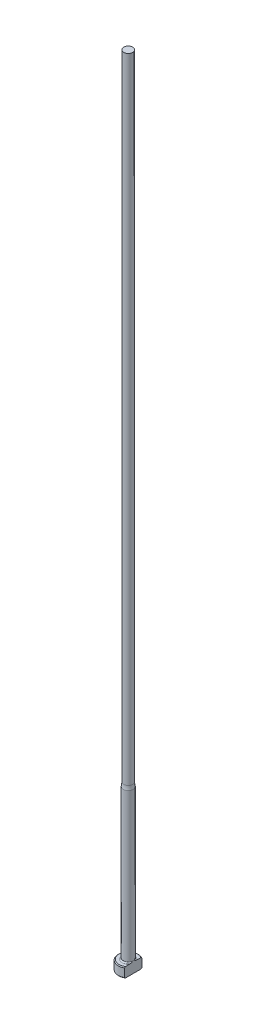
ISO-10303-21;
HEADER;
FILE_DESCRIPTION(('STEP AP214'),'2;1');
FILE_NAME('part.step','',(''),(''),'','','');
FILE_SCHEMA(('AUTOMOTIVE_DESIGN { 1 0 10303 214 1 1 1 1 }'));
ENDSEC;
DATA;
#1=APPLICATION_CONTEXT('core data for automotive mechanical design processes');
#2=APPLICATION_PROTOCOL_DEFINITION('international standard','automotive_design',2000,#1);
#3=PRODUCT_CONTEXT('',#1,'mechanical');
#4=PRODUCT('Part','Part','',(#3));
#5=PRODUCT_RELATED_PRODUCT_CATEGORY('part','',(#4));
#6=PRODUCT_DEFINITION_FORMATION('','',#4);
#7=PRODUCT_DEFINITION_CONTEXT('part definition',#1,'design');
#8=PRODUCT_DEFINITION('design','',#6,#7);
#9=PRODUCT_DEFINITION_SHAPE('','',#8);
#10=(LENGTH_UNIT() NAMED_UNIT(*) SI_UNIT(.MILLI.,.METRE.));
#11=(NAMED_UNIT(*) PLANE_ANGLE_UNIT() SI_UNIT($,.RADIAN.));
#12=(NAMED_UNIT(*) SI_UNIT($,.STERADIAN.) SOLID_ANGLE_UNIT());
#13=UNCERTAINTY_MEASURE_WITH_UNIT(LENGTH_MEASURE(1.E-05),#10,'distance_accuracy_value','');
#14=(GEOMETRIC_REPRESENTATION_CONTEXT(3) GLOBAL_UNCERTAINTY_ASSIGNED_CONTEXT((#13)) GLOBAL_UNIT_ASSIGNED_CONTEXT((#10,
#11,#12)) REPRESENTATION_CONTEXT('',''));
#15=CARTESIAN_POINT('',(0.,0.,0.));
#16=DIRECTION('',(0.,0.,1.));
#17=DIRECTION('',(1.,0.,0.));
#18=AXIS2_PLACEMENT_3D('',#15,#16,#17);
#19=CARTESIAN_POINT('',(-3.17499999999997,3.175,0.));
#20=DIRECTION('',(0.,1.,0.));
#21=DIRECTION('',(0.,0.,1.));
#22=AXIS2_PLACEMENT_3D('',#19,#20,#21);
#23=PLANE('',#22);
#24=CARTESIAN_POINT('',(0.,3.175,0.));
#25=DIRECTION('',(0.,1.,0.));
#26=DIRECTION('',(0.,0.,1.));
#27=AXIS2_PLACEMENT_3D('',#24,#25,#26);
#28=CIRCLE('',#27,2.92099999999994);
#29=CARTESIAN_POINT('',(1.58749999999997,3.175,-2.45195529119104));
#30=VERTEX_POINT('',#29);
#31=CARTESIAN_POINT('',(1.58749999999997,3.175,2.45195529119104));
#32=VERTEX_POINT('',#31);
#33=EDGE_CURVE('E105',#30,#32,#28,.T.);
#34=ORIENTED_EDGE('',*,*,#33,.T.);
#35=DIRECTION('',(0.,0.,1.));
#36=VECTOR('',#35,1.);
#37=CARTESIAN_POINT('',(1.58749999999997,3.17499999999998,2.74963065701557));
#38=LINE('',#37,#36);
#39=CARTESIAN_POINT('',(1.58749999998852,3.175,1.16397422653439));
#40=VERTEX_POINT('',#39);
#41=EDGE_CURVE('E126',#40,#32,#38,.T.);
#42=ORIENTED_EDGE('',*,*,#41,.F.);
#43=CARTESIAN_POINT('',(0.,3.175,0.));
#44=DIRECTION('',(0.,1.,0.));
#45=DIRECTION('',(0.,0.,1.));
#46=AXIS2_PLACEMENT_3D('',#43,#44,#45);
#47=CIRCLE('',#46,1.96849999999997);
#48=CARTESIAN_POINT('',(1.58749999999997,3.175,-1.16397422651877));
#49=VERTEX_POINT('',#48);
#50=EDGE_CURVE('E11',#40,#49,#47,.F.);
#51=ORIENTED_EDGE('',*,*,#50,.T.);
#52=EDGE_CURVE('E52',#30,#49,#38,.T.);
#53=ORIENTED_EDGE('',*,*,#52,.F.);
#54=EDGE_LOOP('',(#34,#42,#51,#53));
#55=FACE_BOUND('',#54,.T.);
#56=ADVANCED_FACE('F32',(#55),#23,.T.);
#57=CARTESIAN_POINT('',(0.,259.958771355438,0.));
#58=DIRECTION('',(0.,1.,0.));
#59=DIRECTION('',(0.,0.,1.));
#60=AXIS2_PLACEMENT_3D('',#57,#58,#59);
#61=CYLINDRICAL_SURFACE('',#60,3.17499999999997);
#62=CARTESIAN_POINT('',(0.,2.92100000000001,0.));
#63=DIRECTION('',(0.,1.,0.));
#64=DIRECTION('',(0.,0.,1.));
#65=AXIS2_PLACEMENT_3D('',#62,#63,#64);
#66=CIRCLE('',#65,3.17499999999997);
#67=CARTESIAN_POINT('',(1.58749999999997,2.92100000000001,2.74963065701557));
#68=VERTEX_POINT('',#67);
#69=CARTESIAN_POINT('',(1.58749999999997,2.92100000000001,-2.74963065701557));
#70=VERTEX_POINT('',#69);
#71=EDGE_CURVE('E98',#68,#70,#66,.F.);
#72=ORIENTED_EDGE('',*,*,#71,.T.);
#73=DIRECTION('',(0.,-1.,0.));
#74=VECTOR('',#73,1.);
#75=CARTESIAN_POINT('',(1.58749999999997,254.001,-2.74963065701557));
#76=LINE('',#75,#74);
#77=CARTESIAN_POINT('',(1.58749999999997,0.253999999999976,-2.74963065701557));
#78=VERTEX_POINT('',#77);
#79=EDGE_CURVE('E141',#70,#78,#76,.T.);
#80=ORIENTED_EDGE('',*,*,#79,.T.);
#81=CARTESIAN_POINT('',(0.,0.253999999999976,0.));
#82=DIRECTION('',(0.,-1.,0.));
#83=DIRECTION('',(0.,0.,-1.));
#84=AXIS2_PLACEMENT_3D('',#81,#82,#83);
#85=CIRCLE('',#84,3.17499999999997);
#86=CARTESIAN_POINT('',(1.58749999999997,0.253999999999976,2.74963065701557));
#87=VERTEX_POINT('',#86);
#88=EDGE_CURVE('E95',#78,#87,#85,.F.);
#89=ORIENTED_EDGE('',*,*,#88,.T.);
#90=DIRECTION('',(0.,-1.,0.));
#91=VECTOR('',#90,1.);
#92=CARTESIAN_POINT('',(1.58749999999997,254.001,2.74963065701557));
#93=LINE('',#92,#91);
#94=EDGE_CURVE('E88',#68,#87,#93,.T.);
#95=ORIENTED_EDGE('',*,*,#94,.F.);
#96=EDGE_LOOP('',(#72,#80,#89,#95));
#97=FACE_BOUND('',#96,.T.);
#98=ADVANCED_FACE('F191',(#97),#61,.T.);
#99=CARTESIAN_POINT('',(0.,0.,0.));
#100=DIRECTION('',(0.,-1.,0.));
#101=DIRECTION('',(0.,0.,-1.));
#102=AXIS2_PLACEMENT_3D('',#99,#100,#101);
#103=PLANE('',#102);
#104=CARTESIAN_POINT('',(0.,0.,0.));
#105=DIRECTION('',(0.,-1.,0.));
#106=DIRECTION('',(0.,0.,-1.));
#107=AXIS2_PLACEMENT_3D('',#104,#105,#106);
#108=CIRCLE('',#107,2.92100000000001);
#109=CARTESIAN_POINT('',(1.58749999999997,0.,2.45195529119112));
#110=VERTEX_POINT('',#109);
#111=CARTESIAN_POINT('',(1.58749999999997,0.,-2.45195529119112));
#112=VERTEX_POINT('',#111);
#113=EDGE_CURVE('E93',#110,#112,#108,.T.);
#114=ORIENTED_EDGE('',*,*,#113,.T.);
#115=DIRECTION('',(0.,0.,1.));
#116=VECTOR('',#115,1.);
#117=CARTESIAN_POINT('',(1.58749999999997,0.,2.74963065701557));
#118=LINE('',#117,#116);
#119=EDGE_CURVE('E78',#112,#110,#118,.T.);
#120=ORIENTED_EDGE('',*,*,#119,.T.);
#121=EDGE_LOOP('',(#114,#120));
#122=FACE_BOUND('',#121,.T.);
#123=ADVANCED_FACE('F97',(#122),#103,.T.);
#124=CARTESIAN_POINT('',(0.,3.17499999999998,0.));
#125=DIRECTION('',(0.,-1.,0.));
#126=DIRECTION('',(0.,0.,-1.));
#127=AXIS2_PLACEMENT_3D('',#124,#125,#126);
#128=CONICAL_SURFACE('',#127,2.92099999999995,0.785398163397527);
#129=ORIENTED_EDGE('',*,*,#71,.F.);
#130=CARTESIAN_POINT('',(1.58749999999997,-0.16162066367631,-6.0529050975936));
#131=CARTESIAN_POINT('',(1.58749999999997,-0.0288893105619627,-5.91567682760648));
#132=CARTESIAN_POINT('',(1.58749999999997,0.103699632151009,-5.7783103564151));
#133=CARTESIAN_POINT('',(1.58749999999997,0.368508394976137,-5.50321874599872));
#134=CARTESIAN_POINT('',(1.58749999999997,0.500728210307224,-5.36549360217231));
#135=CARTESIAN_POINT('',(1.58749999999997,0.764778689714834,-5.08953516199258));
#136=CARTESIAN_POINT('',(1.58749999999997,0.896609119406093,-4.9513016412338));
#137=CARTESIAN_POINT('',(1.58749999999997,1.15968706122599,-4.67428233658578));
#138=CARTESIAN_POINT('',(1.58749999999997,1.29093457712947,-4.53549655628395));
#139=CARTESIAN_POINT('',(1.58749999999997,1.55007705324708,-4.25997724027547));
#140=CARTESIAN_POINT('',(1.58749999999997,1.67798684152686,-4.12325766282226));
#141=CARTESIAN_POINT('',(1.58749999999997,1.9328486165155,-3.84892898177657));
#142=CARTESIAN_POINT('',(1.58749999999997,2.05980060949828,-3.71131988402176));
#143=CARTESIAN_POINT('',(1.58749999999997,2.31237508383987,-3.43493978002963));
#144=CARTESIAN_POINT('',(1.58749999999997,2.43799784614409,-3.29616903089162));
#145=CARTESIAN_POINT('',(1.58749999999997,2.68741369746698,-3.01699558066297));
#146=CARTESIAN_POINT('',(1.58749999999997,2.81120686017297,-2.8765929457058));
#147=CARTESIAN_POINT('',(1.58749999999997,3.00875865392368,-2.64816703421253));
#148=CARTESIAN_POINT('',(1.58749999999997,3.08336151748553,-2.56087478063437));
#149=CARTESIAN_POINT('',(1.58749999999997,3.2312387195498,-2.38515423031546));
#150=CARTESIAN_POINT('',(1.58749999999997,3.30451292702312,-2.29672582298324));
#151=CARTESIAN_POINT('',(1.58749999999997,3.45004422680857,-2.1174740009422));
#152=CARTESIAN_POINT('',(1.58749999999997,3.5222823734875,-2.02663514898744));
#153=CARTESIAN_POINT('',(1.58749999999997,3.66423097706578,-1.8430252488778));
#154=CARTESIAN_POINT('',(1.58749999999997,3.73394203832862,-1.75025467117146));
#155=CARTESIAN_POINT('',(1.58749999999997,3.87080633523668,-1.5606747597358));
#156=CARTESIAN_POINT('',(1.58749999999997,3.93790459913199,-1.46382547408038));
#157=CARTESIAN_POINT('',(1.58749999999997,4.06669147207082,-1.26632594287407));
#158=CARTESIAN_POINT('',(1.58749999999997,4.1283726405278,-1.16567073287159));
#159=CARTESIAN_POINT('',(1.58749999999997,4.21402252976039,-1.01165766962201));
#160=CARTESIAN_POINT('',(1.58749999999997,4.24127929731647,-0.960142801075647));
#161=CARTESIAN_POINT('',(1.58749999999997,4.2930979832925,-0.855780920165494));
#162=CARTESIAN_POINT('',(1.58749999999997,4.31765941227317,-0.802933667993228));
#163=CARTESIAN_POINT('',(1.58749999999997,4.38614656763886,-0.642461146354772));
#164=CARTESIAN_POINT('',(1.58749999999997,4.42510149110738,-0.532518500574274));
#165=CARTESIAN_POINT('',(1.58749999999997,4.46726244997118,-0.367680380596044));
#166=CARTESIAN_POINT('',(1.58749999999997,4.47844427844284,-0.314802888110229));
#167=CARTESIAN_POINT('',(1.58749999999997,4.49576654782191,-0.208209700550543));
#168=CARTESIAN_POINT('',(1.58749999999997,4.50190743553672,-0.154494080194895));
#169=CARTESIAN_POINT('',(1.58749999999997,4.50871296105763,-0.0468792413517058));
#170=CARTESIAN_POINT('',(1.58749999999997,4.5093945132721,0.00701889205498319));
#171=CARTESIAN_POINT('',(1.58749999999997,4.50527679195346,0.114606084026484));
#172=CARTESIAN_POINT('',(1.58749999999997,4.50047706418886,0.168295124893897));
#173=CARTESIAN_POINT('',(1.58749999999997,4.48579689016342,0.27448544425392));
#174=CARTESIAN_POINT('',(1.58749999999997,4.47596081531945,0.32699298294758));
#175=CARTESIAN_POINT('',(1.58749999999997,4.45181809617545,0.430974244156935));
#176=CARTESIAN_POINT('',(1.58749999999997,4.4375096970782,0.482447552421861));
#177=CARTESIAN_POINT('',(1.58749999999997,4.40502489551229,0.584460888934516));
#178=CARTESIAN_POINT('',(1.58749999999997,4.386827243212,0.634994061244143));
#179=CARTESIAN_POINT('',(1.58749999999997,4.34729308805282,0.734789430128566));
#180=CARTESIAN_POINT('',(1.58749999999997,4.3259572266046,0.784051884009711));
#181=CARTESIAN_POINT('',(1.58749999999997,4.25791922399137,0.930549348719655));
#182=CARTESIAN_POINT('',(1.58749999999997,4.20736047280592,1.0259880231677));
#183=CARTESIAN_POINT('',(1.58749999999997,4.0995545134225,1.21304313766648));
#184=CARTESIAN_POINT('',(1.58749999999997,4.04229912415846,1.30465471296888));
#185=CARTESIAN_POINT('',(1.58749999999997,3.92308746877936,1.48526211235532));
#186=CARTESIAN_POINT('',(1.58749999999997,3.86111349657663,1.57424615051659));
#187=CARTESIAN_POINT('',(1.58749999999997,3.73408621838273,1.74990003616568));
#188=CARTESIAN_POINT('',(1.58749999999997,3.66903444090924,1.83657099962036));
#189=CARTESIAN_POINT('',(1.58749999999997,3.53583371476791,2.00931764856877));
#190=CARTESIAN_POINT('',(1.58749999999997,3.46765527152,2.09537048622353));
#191=CARTESIAN_POINT('',(1.58749999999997,3.32960643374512,2.26611736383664));
#192=CARTESIAN_POINT('',(1.58749999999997,3.25973586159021,2.35081125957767));
#193=CARTESIAN_POINT('',(1.58749999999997,3.04858139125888,2.60290121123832));
#194=CARTESIAN_POINT('',(1.58749999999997,2.90542388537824,2.76872537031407));
#195=CARTESIAN_POINT('',(1.58749999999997,2.64069522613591,3.06970913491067));
#196=CARTESIAN_POINT('',(1.58749999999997,2.51959458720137,3.20528660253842));
#197=CARTESIAN_POINT('',(1.58749999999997,2.27590400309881,3.47510321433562));
#198=CARTESIAN_POINT('',(1.58749999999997,2.15331401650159,3.60934232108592));
#199=CARTESIAN_POINT('',(1.58749999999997,1.90694239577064,3.87695374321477));
#200=CARTESIAN_POINT('',(1.58749999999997,1.78315974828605,4.0103251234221));
#201=CARTESIAN_POINT('',(1.58749999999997,1.53478104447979,4.27630880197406));
#202=CARTESIAN_POINT('',(1.58749999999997,1.41018498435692,4.40892109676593));
#203=CARTESIAN_POINT('',(1.58749999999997,1.0457468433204,4.79499418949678));
#204=CARTESIAN_POINT('',(1.58749999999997,0.80507680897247,5.04767313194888));
#205=CARTESIAN_POINT('',(1.58749999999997,0.443121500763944,5.42550911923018));
#206=CARTESIAN_POINT('',(1.58749999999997,0.322378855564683,5.55118772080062));
#207=CARTESIAN_POINT('',(1.58749999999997,0.0805914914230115,5.80225207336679));
#208=CARTESIAN_POINT('',(1.58749999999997,-0.040453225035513,5.92763782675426));
#209=CARTESIAN_POINT('',(1.58749999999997,-0.161620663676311,6.0529050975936));
#210=B_SPLINE_CURVE_WITH_KNOTS('',3,(#130,#131,#132,#133,#134,#135,#136,#137,#138,#139,#140,
#141,#142,#143,#144,#145,#146,#147,#148,#149,#150,#151,#152,#153,#154,#155,#156,#157,#158,#159,
#160,#161,#162,#163,#164,#165,#166,#167,#168,#169,#170,#171,#172,#173,#174,#175,#176,#177,#178,
#179,#180,#181,#182,#183,#184,#185,#186,#187,#188,#189,#190,#191,#192,#193,#194,#195,#196,#197,
#198,#199,#200,#201,#202,#203,#204,#205,#206,#207,#208,#209),.UNSPECIFIED.,.F.,.F.,(4,2,2,2,2,2,
2,2,2,2,2,2,2,2,2,2,2,2,2,2,2,2,2,2,2,2,2,2,2,2,2,2,2,2,2,2,2,2,2,4),(0.,0.572750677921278,
1.14550874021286,1.71856057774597,2.29160869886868,2.85328006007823,3.4149477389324,
3.97649423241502,4.53801804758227,4.88249307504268,5.22700189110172,5.5751532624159,
5.92322081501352,6.27657800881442,6.63041319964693,6.80518126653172,6.9799810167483,
7.3282426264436,7.49018491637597,7.65211285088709,7.81353889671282,7.97497832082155,
8.13501929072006,8.29512313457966,8.45612518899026,8.61709438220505,8.94062993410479,
9.2645649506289,9.58978187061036,9.91483894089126,10.2441741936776,10.5735441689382,
11.2306812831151,11.7760337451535,12.3214014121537,12.8672825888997,13.4131663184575,
14.4600164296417,14.9828595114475,15.5056983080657),.UNSPECIFIED.);
#211=EDGE_CURVE('E118',#32,#68,#210,.T.);
#212=ORIENTED_EDGE('',*,*,#211,.F.);
#213=ORIENTED_EDGE('',*,*,#33,.F.);
#214=EDGE_CURVE('E117',#70,#30,#210,.T.);
#215=ORIENTED_EDGE('',*,*,#214,.F.);
#216=EDGE_LOOP('',(#129,#212,#213,#215));
#217=FACE_BOUND('',#216,.T.);
#218=ADVANCED_FACE('F162',(#217),#128,.T.);
#219=CARTESIAN_POINT('',(0.,0.253999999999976,0.));
#220=DIRECTION('',(0.,1.,0.));
#221=DIRECTION('',(0.,0.,1.));
#222=AXIS2_PLACEMENT_3D('',#219,#220,#221);
#223=CONICAL_SURFACE('',#222,3.17499999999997,0.785398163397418);
#224=ORIENTED_EDGE('',*,*,#88,.F.);
#225=CARTESIAN_POINT('',(1.58749999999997,3.33662066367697,6.0529050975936));
#226=CARTESIAN_POINT('',(1.58749999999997,3.20388931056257,5.91567682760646));
#227=CARTESIAN_POINT('',(1.58749999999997,3.07130036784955,5.77831035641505));
#228=CARTESIAN_POINT('',(1.58749999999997,2.80649160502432,5.50321874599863));
#229=CARTESIAN_POINT('',(1.58749999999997,2.67427178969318,5.3654936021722));
#230=CARTESIAN_POINT('',(1.58749999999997,2.41022131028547,5.08953516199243));
#231=CARTESIAN_POINT('',(1.58749999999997,2.27839088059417,4.95130164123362));
#232=CARTESIAN_POINT('',(1.58749999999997,2.01531293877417,4.67428233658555));
#233=CARTESIAN_POINT('',(1.58749999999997,1.88406542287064,4.5354965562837));
#234=CARTESIAN_POINT('',(1.58749999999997,1.62492294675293,4.25997724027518));
#235=CARTESIAN_POINT('',(1.58749999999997,1.49701315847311,4.12325766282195));
#236=CARTESIAN_POINT('',(1.58749999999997,1.24215138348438,3.84892898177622));
#237=CARTESIAN_POINT('',(1.58749999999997,1.11519939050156,3.71131988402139));
#238=CARTESIAN_POINT('',(1.58749999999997,0.862624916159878,3.43493978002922));
#239=CARTESIAN_POINT('',(1.58749999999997,0.737002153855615,3.29616903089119));
#240=CARTESIAN_POINT('',(1.58749999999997,0.487586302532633,3.01699558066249));
#241=CARTESIAN_POINT('',(1.58749999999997,0.363793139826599,2.8765929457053));
#242=CARTESIAN_POINT('',(1.58749999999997,0.166241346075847,2.64816703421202));
#243=CARTESIAN_POINT('',(1.58749999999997,0.0916384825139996,2.56087478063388));
#244=CARTESIAN_POINT('',(1.58749999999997,-0.0562387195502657,2.385154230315));
#245=CARTESIAN_POINT('',(1.58749999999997,-0.129512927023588,2.29672582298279));
#246=CARTESIAN_POINT('',(1.58749999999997,-0.27504422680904,2.11747400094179));
#247=CARTESIAN_POINT('',(1.58749999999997,-0.347282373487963,2.02663514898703));
#248=CARTESIAN_POINT('',(1.58749999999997,-0.489230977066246,1.84302524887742));
#249=CARTESIAN_POINT('',(1.58749999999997,-0.558942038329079,1.7502546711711));
#250=CARTESIAN_POINT('',(1.58749999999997,-0.695806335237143,1.56067475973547));
#251=CARTESIAN_POINT('',(1.58749999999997,-0.762904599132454,1.46382547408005));
#252=CARTESIAN_POINT('',(1.58749999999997,-0.891691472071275,1.26632594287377));
#253=CARTESIAN_POINT('',(1.58749999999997,-0.953372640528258,1.16567073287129));
#254=CARTESIAN_POINT('',(1.58749999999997,-1.03902252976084,1.01165766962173));
#255=CARTESIAN_POINT('',(1.58749999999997,-1.06627929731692,0.960142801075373));
#256=CARTESIAN_POINT('',(1.58749999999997,-1.11809798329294,0.85578092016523));
#257=CARTESIAN_POINT('',(1.58749999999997,-1.14265941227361,0.802933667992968));
#258=CARTESIAN_POINT('',(1.58749999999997,-1.21114656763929,0.642461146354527));
#259=CARTESIAN_POINT('',(1.58749999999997,-1.2501014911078,0.532518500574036));
#260=CARTESIAN_POINT('',(1.58749999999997,-1.29226244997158,0.367680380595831));
#261=CARTESIAN_POINT('',(1.58749999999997,-1.30344427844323,0.314802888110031));
#262=CARTESIAN_POINT('',(1.58749999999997,-1.32076654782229,0.208209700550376));
#263=CARTESIAN_POINT('',(1.58749999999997,-1.3269074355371,0.154494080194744));
#264=CARTESIAN_POINT('',(1.58749999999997,-1.333712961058,0.0468792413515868));
#265=CARTESIAN_POINT('',(1.58749999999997,-1.33439451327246,-0.00701889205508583));
#266=CARTESIAN_POINT('',(1.58749999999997,-1.33027679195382,-0.114606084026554));
#267=CARTESIAN_POINT('',(1.58749999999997,-1.32547706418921,-0.168295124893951));
#268=CARTESIAN_POINT('',(1.58749999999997,-1.31079689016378,-0.274485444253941));
#269=CARTESIAN_POINT('',(1.58749999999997,-1.3009608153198,-0.326992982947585));
#270=CARTESIAN_POINT('',(1.58749999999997,-1.27681809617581,-0.430974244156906));
#271=CARTESIAN_POINT('',(1.58749999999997,-1.26250969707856,-0.482447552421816));
#272=CARTESIAN_POINT('',(1.58749999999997,-1.23002489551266,-0.584460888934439));
#273=CARTESIAN_POINT('',(1.58749999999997,-1.21182724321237,-0.634994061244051));
#274=CARTESIAN_POINT('',(1.58749999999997,-1.1722930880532,-0.734789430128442));
#275=CARTESIAN_POINT('',(1.58749999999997,-1.15095722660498,-0.784051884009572));
#276=CARTESIAN_POINT('',(1.58749999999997,-1.08291922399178,-0.93054934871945));
#277=CARTESIAN_POINT('',(1.58749999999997,-1.03236047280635,-1.02598802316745));
#278=CARTESIAN_POINT('',(1.58749999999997,-0.924554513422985,-1.21304313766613));
#279=CARTESIAN_POINT('',(1.58749999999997,-0.86729912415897,-1.30465471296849));
#280=CARTESIAN_POINT('',(1.58749999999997,-0.748087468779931,-1.48526211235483));
#281=CARTESIAN_POINT('',(1.58749999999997,-0.686113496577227,-1.57424615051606));
#282=CARTESIAN_POINT('',(1.58749999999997,-0.55908621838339,-1.74990003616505));
#283=CARTESIAN_POINT('',(1.58749999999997,-0.494034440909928,-1.83657099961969));
#284=CARTESIAN_POINT('',(1.58749999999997,-0.360833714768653,-2.00931764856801));
#285=CARTESIAN_POINT('',(1.58749999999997,-0.292655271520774,-2.09537048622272));
#286=CARTESIAN_POINT('',(1.58749999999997,-0.154606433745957,-2.26611736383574));
#287=CARTESIAN_POINT('',(1.58749999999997,-0.0847358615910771,-2.35081125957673));
#288=CARTESIAN_POINT('',(1.58749999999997,0.126418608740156,-2.60290121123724));
#289=CARTESIAN_POINT('',(1.58749999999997,0.269576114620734,-2.76872537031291));
#290=CARTESIAN_POINT('',(1.58749999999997,0.534304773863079,-3.06970913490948));
#291=CARTESIAN_POINT('',(1.58749999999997,0.655405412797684,-3.20528660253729));
#292=CARTESIAN_POINT('',(1.58749999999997,0.899095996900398,-3.47510321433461));
#293=CARTESIAN_POINT('',(1.58749999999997,1.02168598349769,-3.60934232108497));
#294=CARTESIAN_POINT('',(1.58749999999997,1.26805760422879,-3.87695374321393));
#295=CARTESIAN_POINT('',(1.58749999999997,1.39184025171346,-4.01032512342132));
#296=CARTESIAN_POINT('',(1.58749999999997,1.64021895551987,-4.2763088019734));
#297=CARTESIAN_POINT('',(1.58749999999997,1.76481501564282,-4.40892109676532));
#298=CARTESIAN_POINT('',(1.58749999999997,2.12925315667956,-4.79499418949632));
#299=CARTESIAN_POINT('',(1.58749999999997,2.36992319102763,-5.04767313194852));
#300=CARTESIAN_POINT('',(1.58749999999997,2.73187849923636,-5.42550911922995));
#301=CARTESIAN_POINT('',(1.58749999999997,2.85262114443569,-5.55118772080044));
#302=CARTESIAN_POINT('',(1.58749999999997,3.09440850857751,-5.8022520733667));
#303=CARTESIAN_POINT('',(1.58749999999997,3.2154532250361,-5.92763782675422));
#304=CARTESIAN_POINT('',(1.58749999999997,3.33662066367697,-6.0529050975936));
#305=B_SPLINE_CURVE_WITH_KNOTS('',3,(#225,#226,#227,#228,#229,#230,#231,#232,#233,#234,#235,
#236,#237,#238,#239,#240,#241,#242,#243,#244,#245,#246,#247,#248,#249,#250,#251,#252,#253,#254,
#255,#256,#257,#258,#259,#260,#261,#262,#263,#264,#265,#266,#267,#268,#269,#270,#271,#272,#273,
#274,#275,#276,#277,#278,#279,#280,#281,#282,#283,#284,#285,#286,#287,#288,#289,#290,#291,#292,
#293,#294,#295,#296,#297,#298,#299,#300,#301,#302,#303,#304),.UNSPECIFIED.,.F.,.F.,(4,2,2,2,2,2,
2,2,2,2,2,2,2,2,2,2,2,2,2,2,2,2,2,2,2,2,2,2,2,2,2,2,2,2,2,2,2,2,2,4),(0.,0.57275067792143,
1.14550874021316,1.71856057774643,2.29160869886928,2.85328006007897,3.41494773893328,
3.97649423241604,4.53801804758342,4.88249307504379,5.2270018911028,5.57515326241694,
5.92322081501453,6.27657800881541,6.63041319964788,6.80518126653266,6.97998101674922,
7.32824262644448,7.49018491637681,7.65211285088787,7.81353889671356,7.97497832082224,
8.1350192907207,8.29512313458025,8.45612518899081,8.61709438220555,8.94062993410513,
9.26456495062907,9.58978187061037,9.91483894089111,10.2441741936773,10.5735441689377,
11.2306812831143,11.776033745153,12.3214014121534,12.8672825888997,13.4131663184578,
14.4600164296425,14.9828595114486,15.505698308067),.UNSPECIFIED.);
#306=EDGE_CURVE('E81',#112,#78,#305,.T.);
#307=ORIENTED_EDGE('',*,*,#306,.F.);
#308=ORIENTED_EDGE('',*,*,#113,.F.);
#309=EDGE_CURVE('E84',#87,#110,#305,.T.);
#310=ORIENTED_EDGE('',*,*,#309,.F.);
#311=EDGE_LOOP('',(#224,#307,#308,#310));
#312=FACE_BOUND('',#311,.T.);
#313=ADVANCED_FACE('F92',(#312),#223,.T.);
#314=CARTESIAN_POINT('',(0.,3.556,0.));
#315=DIRECTION('',(0.,1.,0.));
#316=DIRECTION('',(0.,0.,1.));
#317=AXIS2_PLACEMENT_3D('',#314,#315,#316);
#318=TOROIDAL_SURFACE('',#317,1.96849999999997,0.381);
#319=CARTESIAN_POINT('',(1.58749999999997,3.556,0.));
#320=CARTESIAN_POINT('',(1.58749999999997,3.55599928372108,-9.72839998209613E-12));
#321=CARTESIAN_POINT('',(1.58749999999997,3.55599856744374,-1.16390048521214E-07));
#322=CARTESIAN_POINT('',(1.58749999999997,3.55599717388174,-5.02802253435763E-07));
#323=CARTESIAN_POINT('',(1.58749999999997,3.55599649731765,-7.75049116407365E-07));
#324=CARTESIAN_POINT('',(1.58749999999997,3.55599515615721,-1.43578185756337E-06));
#325=CARTESIAN_POINT('',(1.58749999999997,3.55599449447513,-1.83004116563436E-06));
#326=CARTESIAN_POINT('',(1.58749999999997,3.55599322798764,-2.69326525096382E-06));
#327=CARTESIAN_POINT('',(1.58749999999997,3.55599262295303,-3.16190628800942E-06));
#328=CARTESIAN_POINT('',(1.58749999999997,3.55599066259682,-4.80183833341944E-06));
#329=CARTESIAN_POINT('',(1.58749999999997,3.55598938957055,-6.07237548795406E-06));
#330=CARTESIAN_POINT('',(1.58749999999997,3.55598706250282,-8.74131694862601E-06));
#331=CARTESIAN_POINT('',(1.58749999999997,3.55598600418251,-1.01362054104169E-05));
#332=CARTESIAN_POINT('',(1.58749999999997,3.55598220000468,-1.54025644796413E-05));
#333=CARTESIAN_POINT('',(1.58749999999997,3.55597966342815,-1.94297992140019E-05));
#334=CARTESIAN_POINT('',(1.58749999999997,3.55597535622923,-2.75116574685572E-05));
#335=CARTESIAN_POINT('',(1.58749999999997,3.55597354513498,-3.15456374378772E-05));
#336=CARTESIAN_POINT('',(1.58749999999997,3.55596616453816,-4.82039076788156E-05));
#337=CARTESIAN_POINT('',(1.58749999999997,3.55596077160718,-6.08993138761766E-05));
#338=CARTESIAN_POINT('',(1.58749999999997,3.55595181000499,-8.49758225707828E-05));
#339=CARTESIAN_POINT('',(1.58749999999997,3.55594809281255,-9.6299831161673E-05));
#340=CARTESIAN_POINT('',(1.58749999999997,3.55591954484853,-0.000176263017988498));
#341=CARTESIAN_POINT('',(1.58749999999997,3.55588430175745,-0.000240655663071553));
#342=CARTESIAN_POINT('',(1.58749999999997,3.55575419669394,-0.000487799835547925));
#343=CARTESIAN_POINT('',(1.58749999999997,3.55566706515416,-0.000673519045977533));
#344=CARTESIAN_POINT('',(1.58749999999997,3.55532896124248,-0.00138308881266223));
#345=CARTESIAN_POINT('',(1.58749999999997,3.55506990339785,-0.0019038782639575));
#346=CARTESIAN_POINT('',(1.58749999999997,3.55403272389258,-0.00399959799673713));
#347=CARTESIAN_POINT('',(1.58749999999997,3.55326363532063,-0.0055779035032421));
#348=CARTESIAN_POINT('',(1.58749999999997,3.53734419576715,-0.0382341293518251));
#349=CARTESIAN_POINT('',(1.58749999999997,3.52209124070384,-0.0692744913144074));
#350=CARTESIAN_POINT('',(1.58749999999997,3.49234031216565,-0.130397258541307));
#351=CARTESIAN_POINT('',(1.58749999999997,3.4778343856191,-0.160476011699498));
#352=CARTESIAN_POINT('',(1.58749999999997,3.44756579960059,-0.22405302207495));
#353=CARTESIAN_POINT('',(1.58749999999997,3.43183768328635,-0.257567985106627));
#354=CARTESIAN_POINT('',(1.58749999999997,3.40084315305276,-0.325196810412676));
#355=CARTESIAN_POINT('',(1.58749999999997,3.38558252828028,-0.359313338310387));
#356=CARTESIAN_POINT('',(1.58749999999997,3.35947844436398,-0.419670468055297));
#357=CARTESIAN_POINT('',(1.58749999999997,3.34845502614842,-0.445832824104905));
#358=CARTESIAN_POINT('',(1.58749999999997,3.32703860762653,-0.498343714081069));
#359=CARTESIAN_POINT('',(1.58749999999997,3.31664422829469,-0.52469168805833));
#360=CARTESIAN_POINT('',(1.58749999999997,3.2869407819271,-0.603098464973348));
#361=CARTESIAN_POINT('',(1.58749999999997,3.26865317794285,-0.655557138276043));
#362=CARTESIAN_POINT('',(1.58749999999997,3.24332469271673,-0.737608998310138));
#363=CARTESIAN_POINT('',(1.58749999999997,3.23494346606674,-0.766787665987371));
#364=CARTESIAN_POINT('',(1.58749999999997,3.21949479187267,-0.825628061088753));
#365=CARTESIAN_POINT('',(1.58749999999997,3.21243348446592,-0.855291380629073));
#366=CARTESIAN_POINT('',(1.58749999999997,3.19303275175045,-0.947623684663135));
#367=CARTESIAN_POINT('',(1.58749999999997,3.18336484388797,-1.01091582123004));
#368=CARTESIAN_POINT('',(1.58749999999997,3.17464826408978,-1.12491727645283));
#369=CARTESIAN_POINT('',(1.58749999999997,3.17379742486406,-1.17548103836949));
#370=CARTESIAN_POINT('',(1.58749999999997,3.17980825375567,-1.2756075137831));
#371=CARTESIAN_POINT('',(1.58749999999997,3.18656467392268,-1.32517446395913));
#372=CARTESIAN_POINT('',(1.58749999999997,3.20510062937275,-1.40268723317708));
#373=CARTESIAN_POINT('',(1.58749999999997,3.21379930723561,-1.43136704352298));
#374=CARTESIAN_POINT('',(1.58749999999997,3.23523847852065,-1.48727388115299));
#375=CARTESIAN_POINT('',(1.58749999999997,3.24798385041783,-1.51449910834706));
#376=CARTESIAN_POINT('',(1.58749999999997,3.27479889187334,-1.56082978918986));
#377=CARTESIAN_POINT('',(1.58749999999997,3.2880084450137,-1.5804296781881));
#378=CARTESIAN_POINT('',(1.58749999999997,3.31738741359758,-1.61726850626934));
#379=CARTESIAN_POINT('',(1.58749999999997,3.33355126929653,-1.63451177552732));
#380=CARTESIAN_POINT('',(1.58749999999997,3.3650209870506,-1.66235366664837));
#381=CARTESIAN_POINT('',(1.58749999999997,3.37976591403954,-1.67358404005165));
#382=CARTESIAN_POINT('',(1.58749999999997,3.41090649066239,-1.69348690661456));
#383=CARTESIAN_POINT('',(1.58749999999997,3.42730148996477,-1.70216040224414));
#384=CARTESIAN_POINT('',(1.58749999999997,3.46152587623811,-1.71647536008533));
#385=CARTESIAN_POINT('',(1.58749999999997,3.47936500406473,-1.72209384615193));
#386=CARTESIAN_POINT('',(1.58749999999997,3.51579449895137,-1.72977101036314));
#387=CARTESIAN_POINT('',(1.58749999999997,3.53438431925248,-1.73183223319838));
#388=CARTESIAN_POINT('',(1.58749999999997,3.5693049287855,-1.73220894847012));
#389=CARTESIAN_POINT('',(1.58749999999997,3.58563247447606,-1.73095378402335));
#390=CARTESIAN_POINT('',(1.58749999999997,3.61782719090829,-1.72566824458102));
#391=CARTESIAN_POINT('',(1.58749999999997,3.6336944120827,-1.72163817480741));
#392=CARTESIAN_POINT('',(1.58749999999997,3.66430913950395,-1.71112762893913));
#393=CARTESIAN_POINT('',(1.58749999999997,3.67907021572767,-1.70468621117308));
#394=CARTESIAN_POINT('',(1.58749999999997,3.7074589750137,-1.68967506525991));
#395=CARTESIAN_POINT('',(1.58749999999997,3.72108625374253,-1.68110458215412));
#396=CARTESIAN_POINT('',(1.58749999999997,3.75190835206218,-1.6586320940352));
#397=CARTESIAN_POINT('',(1.58749999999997,3.76852524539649,-1.64393589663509));
#398=CARTESIAN_POINT('',(1.58749999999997,3.79915076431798,-1.61203006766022));
#399=CARTESIAN_POINT('',(1.58749999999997,3.81315342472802,-1.59481484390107));
#400=CARTESIAN_POINT('',(1.58749999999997,3.84335302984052,-1.55180967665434));
#401=CARTESIAN_POINT('',(1.58749999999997,3.85840997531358,-1.52522183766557));
#402=CARTESIAN_POINT('',(1.58749999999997,3.8840928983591,-1.47008223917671));
#403=CARTESIAN_POINT('',(1.58749999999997,3.89472145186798,-1.44153163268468));
#404=CARTESIAN_POINT('',(1.58749999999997,3.91656912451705,-1.36850699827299));
#405=CARTESIAN_POINT('',(1.58749999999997,3.92534811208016,-1.32330828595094));
#406=CARTESIAN_POINT('',(1.58749999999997,3.93598980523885,-1.23163561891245));
#407=CARTESIAN_POINT('',(1.58749999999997,3.93776012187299,-1.18515271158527));
#408=CARTESIAN_POINT('',(1.58749999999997,3.93485724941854,-1.056626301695));
#409=CARTESIAN_POINT('',(1.58749999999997,3.9241811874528,-0.974728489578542));
#410=CARTESIAN_POINT('',(1.58749999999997,3.899893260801,-0.855941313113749));
#411=CARTESIAN_POINT('',(1.58749999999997,3.89075037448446,-0.817952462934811));
#412=CARTESIAN_POINT('',(1.58749999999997,3.87034922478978,-0.742758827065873));
#413=CARTESIAN_POINT('',(1.58749999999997,3.85910312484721,-0.705550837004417));
#414=CARTESIAN_POINT('',(1.58749999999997,3.83067738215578,-0.618900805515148));
#415=CARTESIAN_POINT('',(1.58749999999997,3.81279292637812,-0.56969368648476));
#416=CARTESIAN_POINT('',(1.58749999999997,3.78404415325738,-0.496059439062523));
#417=CARTESIAN_POINT('',(1.58749999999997,3.77402894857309,-0.471293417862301));
#418=CARTESIAN_POINT('',(1.58749999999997,3.75347166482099,-0.421913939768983));
#419=CARTESIAN_POINT('',(1.58749999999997,3.74292842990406,-0.39730096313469));
#420=CARTESIAN_POINT('',(1.58749999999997,3.71797467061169,-0.340371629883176));
#421=CARTESIAN_POINT('',(1.58749999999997,3.7034106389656,-0.308122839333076));
#422=CARTESIAN_POINT('',(1.58749999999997,3.67389634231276,-0.244169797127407));
#423=CARTESIAN_POINT('',(1.58749999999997,3.65895097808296,-0.212463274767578));
#424=CARTESIAN_POINT('',(1.58749999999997,3.63022587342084,-0.152300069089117));
#425=CARTESIAN_POINT('',(1.58749999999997,3.61647532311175,-0.123829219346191));
#426=CARTESIAN_POINT('',(1.58749999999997,3.58829058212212,-0.065967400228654));
#427=CARTESIAN_POINT('',(1.58749999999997,3.57384944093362,-0.036579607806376));
#428=CARTESIAN_POINT('',(1.58749999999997,3.55873641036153,-0.00557801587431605));
#429=CARTESIAN_POINT('',(1.58749999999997,3.557967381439,-0.00399981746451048));
#430=CARTESIAN_POINT('',(1.58749999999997,3.55693021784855,-0.00190412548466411));
#431=CARTESIAN_POINT('',(1.58749999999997,3.55667111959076,-0.00138325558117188));
#432=CARTESIAN_POINT('',(1.58749999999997,3.55633296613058,-0.00067358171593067));
#433=CARTESIAN_POINT('',(1.58749999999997,3.55624582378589,-0.000487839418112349));
#434=CARTESIAN_POINT('',(1.58749999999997,3.55611570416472,-0.000240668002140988));
#435=CARTESIAN_POINT('',(1.58749999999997,3.55608045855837,-0.000176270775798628));
#436=CARTESIAN_POINT('',(1.58749999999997,3.55605190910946,-9.63021903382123E-05));
#437=CARTESIAN_POINT('',(1.58749999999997,3.55604819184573,-8.49777827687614E-05));
#438=CARTESIAN_POINT('',(1.58749999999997,3.55603922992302,-6.09004217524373E-05));
#439=CARTESIAN_POINT('',(1.58749999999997,3.55603383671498,-4.82045726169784E-05));
#440=CARTESIAN_POINT('',(1.58749999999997,3.55602645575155,-3.15458034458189E-05));
#441=CARTESIAN_POINT('',(1.58749999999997,3.55602464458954,-2.75117552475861E-05));
#442=CARTESIAN_POINT('',(1.58749999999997,3.55602033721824,-1.94297725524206E-05));
#443=CARTESIAN_POINT('',(1.58749999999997,3.55601780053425,-1.54024835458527E-05));
#444=CARTESIAN_POINT('',(1.58749999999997,3.55601399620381,-1.01360754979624E-05));
#445=CARTESIAN_POINT('',(1.58749999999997,3.55601293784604,-8.7411813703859E-06));
#446=CARTESIAN_POINT('',(1.58749999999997,3.55601061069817,-6.07223627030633E-06));
#447=CARTESIAN_POINT('',(1.58749999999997,3.55600933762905,-4.80170138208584E-06));
#448=CARTESIAN_POINT('',(1.58749999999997,3.55600737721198,-3.16178168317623E-06));
#449=CARTESIAN_POINT('',(1.58749999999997,3.55600677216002,-2.69314602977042E-06));
#450=CARTESIAN_POINT('',(1.58749999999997,3.55600550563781,-1.82993577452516E-06));
#451=CARTESIAN_POINT('',(1.58749999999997,3.55600484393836,-1.43568493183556E-06));
#452=CARTESIAN_POINT('',(1.58749999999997,3.55600350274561,-7.74972790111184E-07));
#453=CARTESIAN_POINT('',(1.58749999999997,3.55600282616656,-5.02737772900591E-07));
#454=CARTESIAN_POINT('',(1.58749999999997,3.55600143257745,-1.16354060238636E-07));
#455=CARTESIAN_POINT('',(1.58749999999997,3.55600071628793,9.72852226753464E-12));
#456=CARTESIAN_POINT('',(1.58749999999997,3.556,0.));
#457=B_SPLINE_CURVE_WITH_KNOTS('',3,(#319,#320,#321,#322,#323,#324,#325,#326,#327,#328,#329,
#330,#331,#332,#333,#334,#335,#336,#337,#338,#339,#340,#341,#342,#343,#344,#345,#346,#347,#348,
#349,#350,#351,#352,#353,#354,#355,#356,#357,#358,#359,#360,#361,#362,#363,#364,#365,#366,#367,
#368,#369,#370,#371,#372,#373,#374,#375,#376,#377,#378,#379,#380,#381,#382,#383,#384,#385,#386,
#387,#388,#389,#390,#391,#392,#393,#394,#395,#396,#397,#398,#399,#400,#401,#402,#403,#404,#405,
#406,#407,#408,#409,#410,#411,#412,#413,#414,#415,#416,#417,#418,#419,#420,#421,#422,#423,#424,
#425,#426,#427,#428,#429,#430,#431,#432,#433,#434,#435,#436,#437,#438,#439,#440,#441,#442,#443,
#444,#445,#446,#447,#448,#449,#450,#451,#452,#453,#454,#455,#456),.UNSPECIFIED.,.T.,.F.,(4,2,2,
2,2,2,2,2,2,2,2,2,2,2,2,2,2,2,2,2,2,2,2,2,2,2,2,2,2,2,2,2,2,2,2,2,2,2,2,2,2,2,2,2,2,2,2,2,2,2,2,
2,2,2,2,2,2,2,2,2,2,2,2,2,2,2,2,2,4),(0.,2.14653634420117E-06,4.3243617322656E-06,
6.62715069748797E-06,8.92017875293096E-06,1.42892293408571E-05,1.95376032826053E-05,
3.37616071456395E-05,4.70144492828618E-05,8.83789092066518E-05,0.000124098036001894,
0.000343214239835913,0.000959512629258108,0.00270343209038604,0.00797166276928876,
0.11171345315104,0.21189766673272,0.322958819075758,0.435072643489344,0.520234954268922,
0.605203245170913,0.771741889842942,0.862787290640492,0.954246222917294,1.14571222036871,
1.29701464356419,1.44624921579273,1.53592478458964,1.62570887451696,1.69637166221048,
1.76690281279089,1.82229027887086,1.87765600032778,1.93343255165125,1.98916918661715,
2.03805361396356,2.08693266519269,2.13505202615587,2.18318847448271,2.24937187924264,
2.31570450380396,2.4068617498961,2.49796589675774,2.63532677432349,2.77449244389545,
3.02069049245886,3.13789423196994,3.25444001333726,3.41142684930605,3.491566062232,
3.57188909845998,3.67803747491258,3.78319074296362,3.87804579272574,3.97626481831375,
3.98153268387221,3.98327687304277,3.98389324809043,3.98411237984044,3.98414810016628,
3.98418946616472,3.98420271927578,3.98421694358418,3.98422219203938,3.9842275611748,
3.98422985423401,3.98423215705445,3.98423433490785,3.98423648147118),.UNSPECIFIED.);
#458=CARTESIAN_POINT('',(1.58749999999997,3.556,0.));
#459=VERTEX_POINT('',#458);
#460=EDGE_CURVE('E47',#459,#49,#457,.T.);
#461=ORIENTED_EDGE('',*,*,#460,.T.);
#462=ORIENTED_EDGE('',*,*,#50,.F.);
#463=CARTESIAN_POINT('',(1.58749999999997,3.556,0.));
#464=CARTESIAN_POINT('',(1.58749999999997,3.55600071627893,9.72842792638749E-12));
#465=CARTESIAN_POINT('',(1.58749999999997,3.55600143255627,1.16390048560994E-07));
#466=CARTESIAN_POINT('',(1.58749999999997,3.55600282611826,5.02802253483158E-07));
#467=CARTESIAN_POINT('',(1.58749999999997,3.55600350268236,7.7504911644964E-07));
#468=CARTESIAN_POINT('',(1.58749999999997,3.5560048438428,1.43578185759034E-06));
#469=CARTESIAN_POINT('',(1.58749999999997,3.55600550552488,1.83004116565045E-06));
#470=CARTESIAN_POINT('',(1.58749999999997,3.55600677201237,2.69326525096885E-06));
#471=CARTESIAN_POINT('',(1.58749999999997,3.55600737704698,3.16190628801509E-06));
#472=CARTESIAN_POINT('',(1.58749999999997,3.55600933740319,4.80183833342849E-06));
#473=CARTESIAN_POINT('',(1.58749999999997,3.55601061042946,6.07237548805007E-06));
#474=CARTESIAN_POINT('',(1.58749999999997,3.55601293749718,8.74131694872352E-06));
#475=CARTESIAN_POINT('',(1.58749999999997,3.55601399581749,1.01362054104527E-05));
#476=CARTESIAN_POINT('',(1.58749999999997,3.55601779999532,1.54025644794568E-05));
#477=CARTESIAN_POINT('',(1.58749999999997,3.55602033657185,1.94297992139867E-05));
#478=CARTESIAN_POINT('',(1.58749999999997,3.55602464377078,2.75116574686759E-05));
#479=CARTESIAN_POINT('',(1.58749999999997,3.55602645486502,3.15456374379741E-05));
#480=CARTESIAN_POINT('',(1.58749999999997,3.55603383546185,4.8203907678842E-05));
#481=CARTESIAN_POINT('',(1.58749999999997,3.55603922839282,6.0899313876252E-05));
#482=CARTESIAN_POINT('',(1.58749999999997,3.55604818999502,8.49758225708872E-05));
#483=CARTESIAN_POINT('',(1.58749999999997,3.55605190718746,9.62998311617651E-05));
#484=CARTESIAN_POINT('',(1.58749999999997,3.55608045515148,0.000176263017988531));
#485=CARTESIAN_POINT('',(1.58749999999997,3.55611569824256,0.000240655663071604));
#486=CARTESIAN_POINT('',(1.58749999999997,3.55624580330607,0.000487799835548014));
#487=CARTESIAN_POINT('',(1.58749999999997,3.55633293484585,0.000673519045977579));
#488=CARTESIAN_POINT('',(1.58749999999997,3.55667103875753,0.00138308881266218));
#489=CARTESIAN_POINT('',(1.58749999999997,3.55693009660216,0.00190387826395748));
#490=CARTESIAN_POINT('',(1.58749999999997,3.55796727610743,0.00399959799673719));
#491=CARTESIAN_POINT('',(1.58749999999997,3.55873636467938,0.00557790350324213));
#492=CARTESIAN_POINT('',(1.58749999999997,3.57465580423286,0.038234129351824));
#493=CARTESIAN_POINT('',(1.58749999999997,3.58990875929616,0.0692744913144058));
#494=CARTESIAN_POINT('',(1.58749999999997,3.61965968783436,0.130397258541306));
#495=CARTESIAN_POINT('',(1.58749999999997,3.63416561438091,0.160476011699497));
#496=CARTESIAN_POINT('',(1.58749999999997,3.66443420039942,0.22405302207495));
#497=CARTESIAN_POINT('',(1.58749999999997,3.68016231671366,0.257567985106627));
#498=CARTESIAN_POINT('',(1.58749999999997,3.71115684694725,0.325196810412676));
#499=CARTESIAN_POINT('',(1.58749999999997,3.72641747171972,0.359313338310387));
#500=CARTESIAN_POINT('',(1.58749999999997,3.75252155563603,0.419670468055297));
#501=CARTESIAN_POINT('',(1.58749999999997,3.76354497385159,0.445832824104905));
#502=CARTESIAN_POINT('',(1.58749999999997,3.78496139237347,0.498343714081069));
#503=CARTESIAN_POINT('',(1.58749999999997,3.79535577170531,0.524691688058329));
#504=CARTESIAN_POINT('',(1.58749999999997,3.82505921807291,0.603098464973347));
#505=CARTESIAN_POINT('',(1.58749999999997,3.84334682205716,0.655557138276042));
#506=CARTESIAN_POINT('',(1.58749999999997,3.86867530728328,0.737608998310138));
#507=CARTESIAN_POINT('',(1.58749999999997,3.87705653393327,0.766787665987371));
#508=CARTESIAN_POINT('',(1.58749999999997,3.89250520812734,0.825628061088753));
#509=CARTESIAN_POINT('',(1.58749999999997,3.89956651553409,0.855291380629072));
#510=CARTESIAN_POINT('',(1.58749999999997,3.91896724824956,0.947623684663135));
#511=CARTESIAN_POINT('',(1.58749999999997,3.92863515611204,1.01091582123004));
#512=CARTESIAN_POINT('',(1.58749999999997,3.93735173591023,1.12491727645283));
#513=CARTESIAN_POINT('',(1.58749999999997,3.93820257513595,1.17548103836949));
#514=CARTESIAN_POINT('',(1.58749999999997,3.93219174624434,1.2756075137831));
#515=CARTESIAN_POINT('',(1.58749999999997,3.92543532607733,1.32517446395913));
#516=CARTESIAN_POINT('',(1.58749999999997,3.90689937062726,1.40268723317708));
#517=CARTESIAN_POINT('',(1.58749999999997,3.8982006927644,1.43136704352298));
#518=CARTESIAN_POINT('',(1.58749999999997,3.87676152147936,1.48727388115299));
#519=CARTESIAN_POINT('',(1.58749999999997,3.86401614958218,1.51449910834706));
#520=CARTESIAN_POINT('',(1.58749999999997,3.83720110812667,1.56082978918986));
#521=CARTESIAN_POINT('',(1.58749999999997,3.82399155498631,1.5804296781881));
#522=CARTESIAN_POINT('',(1.58749999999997,3.79461258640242,1.61726850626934));
#523=CARTESIAN_POINT('',(1.58749999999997,3.77844873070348,1.63451177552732));
#524=CARTESIAN_POINT('',(1.58749999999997,3.74697901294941,1.66235366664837));
#525=CARTESIAN_POINT('',(1.58749999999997,3.73223408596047,1.67358404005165));
#526=CARTESIAN_POINT('',(1.58749999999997,3.70109350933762,1.69348690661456));
#527=CARTESIAN_POINT('',(1.58749999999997,3.68469851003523,1.70216040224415));
#528=CARTESIAN_POINT('',(1.58749999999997,3.65047412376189,1.71647536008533));
#529=CARTESIAN_POINT('',(1.58749999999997,3.63263499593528,1.72209384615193));
#530=CARTESIAN_POINT('',(1.58749999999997,3.59620550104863,1.72977101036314));
#531=CARTESIAN_POINT('',(1.58749999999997,3.57761568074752,1.73183223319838));
#532=CARTESIAN_POINT('',(1.58749999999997,3.54269507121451,1.73220894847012));
#533=CARTESIAN_POINT('',(1.58749999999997,3.52636752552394,1.73095378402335));
#534=CARTESIAN_POINT('',(1.58749999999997,3.49417280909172,1.72566824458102));
#535=CARTESIAN_POINT('',(1.58749999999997,3.47830558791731,1.72163817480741));
#536=CARTESIAN_POINT('',(1.58749999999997,3.44769086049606,1.71112762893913));
#537=CARTESIAN_POINT('',(1.58749999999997,3.43292978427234,1.70468621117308));
#538=CARTESIAN_POINT('',(1.58749999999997,3.40454102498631,1.68967506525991));
#539=CARTESIAN_POINT('',(1.58749999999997,3.39091374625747,1.68110458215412));
#540=CARTESIAN_POINT('',(1.58749999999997,3.36009164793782,1.6586320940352));
#541=CARTESIAN_POINT('',(1.58749999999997,3.34347475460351,1.64393589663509));
#542=CARTESIAN_POINT('',(1.58749999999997,3.31284923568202,1.61203006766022));
#543=CARTESIAN_POINT('',(1.58749999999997,3.29884657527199,1.59481484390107));
#544=CARTESIAN_POINT('',(1.58749999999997,3.26864697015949,1.55180967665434));
#545=CARTESIAN_POINT('',(1.58749999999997,3.25359002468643,1.52522183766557));
#546=CARTESIAN_POINT('',(1.58749999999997,3.22790710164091,1.47008223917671));
#547=CARTESIAN_POINT('',(1.58749999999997,3.21727854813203,1.44153163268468));
#548=CARTESIAN_POINT('',(1.58749999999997,3.19543087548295,1.36850699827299));
#549=CARTESIAN_POINT('',(1.58749999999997,3.18665188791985,1.32330828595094));
#550=CARTESIAN_POINT('',(1.58749999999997,3.17601019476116,1.23163561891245));
#551=CARTESIAN_POINT('',(1.58749999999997,3.17423987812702,1.18515271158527));
#552=CARTESIAN_POINT('',(1.58749999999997,3.17714275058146,1.05662630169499));
#553=CARTESIAN_POINT('',(1.58749999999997,3.18781881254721,0.974728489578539));
#554=CARTESIAN_POINT('',(1.58749999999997,3.21210673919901,0.855941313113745));
#555=CARTESIAN_POINT('',(1.58749999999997,3.22124962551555,0.817952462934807));
#556=CARTESIAN_POINT('',(1.58749999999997,3.24165077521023,0.742758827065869));
#557=CARTESIAN_POINT('',(1.58749999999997,3.25289687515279,0.705550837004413));
#558=CARTESIAN_POINT('',(1.58749999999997,3.28132261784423,0.618900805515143));
#559=CARTESIAN_POINT('',(1.58749999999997,3.29920707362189,0.569693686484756));
#560=CARTESIAN_POINT('',(1.58749999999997,3.32795584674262,0.496059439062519));
#561=CARTESIAN_POINT('',(1.58749999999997,3.33797105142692,0.471293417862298));
#562=CARTESIAN_POINT('',(1.58749999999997,3.35852833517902,0.42191393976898));
#563=CARTESIAN_POINT('',(1.58749999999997,3.36907157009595,0.397300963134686));
#564=CARTESIAN_POINT('',(1.58749999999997,3.39402532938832,0.340371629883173));
#565=CARTESIAN_POINT('',(1.58749999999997,3.40858936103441,0.308122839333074));
#566=CARTESIAN_POINT('',(1.58749999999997,3.43810365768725,0.244169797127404));
#567=CARTESIAN_POINT('',(1.58749999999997,3.45304902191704,0.212463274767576));
#568=CARTESIAN_POINT('',(1.58749999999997,3.48177412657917,0.152300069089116));
#569=CARTESIAN_POINT('',(1.58749999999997,3.49552467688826,0.123829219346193));
#570=CARTESIAN_POINT('',(1.58749999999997,3.52370941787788,0.0659674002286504));
#571=CARTESIAN_POINT('',(1.58749999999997,3.53815055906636,0.0365796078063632));
#572=CARTESIAN_POINT('',(1.58749999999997,3.55326358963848,0.00557801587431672));
#573=CARTESIAN_POINT('',(1.58749999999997,3.55403261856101,0.00399981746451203));
#574=CARTESIAN_POINT('',(1.58749999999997,3.55506978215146,0.00190412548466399));
#575=CARTESIAN_POINT('',(1.58749999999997,3.55532888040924,0.00138325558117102));
#576=CARTESIAN_POINT('',(1.58749999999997,3.55566703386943,0.00067358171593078));
#577=CARTESIAN_POINT('',(1.58749999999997,3.55575417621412,0.000487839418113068));
#578=CARTESIAN_POINT('',(1.58749999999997,3.55588429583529,0.000240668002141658));
#579=CARTESIAN_POINT('',(1.58749999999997,3.55591954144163,0.000176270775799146));
#580=CARTESIAN_POINT('',(1.58749999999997,3.55594809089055,9.63021903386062E-05));
#581=CARTESIAN_POINT('',(1.58749999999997,3.55595180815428,8.49777827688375E-05));
#582=CARTESIAN_POINT('',(1.58749999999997,3.55596077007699,6.09004217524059E-05));
#583=CARTESIAN_POINT('',(1.58749999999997,3.55596616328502,4.82045726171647E-05));
#584=CARTESIAN_POINT('',(1.58749999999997,3.55597354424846,3.15458034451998E-05));
#585=CARTESIAN_POINT('',(1.58749999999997,3.55597535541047,2.75117552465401E-05));
#586=CARTESIAN_POINT('',(1.58749999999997,3.55597966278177,1.94297725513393E-05));
#587=CARTESIAN_POINT('',(1.58749999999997,3.55598219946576,1.54024835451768E-05));
#588=CARTESIAN_POINT('',(1.58749999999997,3.5559860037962,1.01360754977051E-05));
#589=CARTESIAN_POINT('',(1.58749999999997,3.55598706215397,8.74118137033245E-06));
#590=CARTESIAN_POINT('',(1.58749999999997,3.55598938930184,6.07223627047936E-06));
#591=CARTESIAN_POINT('',(1.58749999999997,3.55599066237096,4.80170138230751E-06));
#592=CARTESIAN_POINT('',(1.58749999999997,3.55599262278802,3.16178168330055E-06));
#593=CARTESIAN_POINT('',(1.58749999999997,3.55599322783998,2.69314602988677E-06));
#594=CARTESIAN_POINT('',(1.58749999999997,3.55599449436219,1.82993577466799E-06));
#595=CARTESIAN_POINT('',(1.58749999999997,3.55599515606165,1.43568493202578E-06));
#596=CARTESIAN_POINT('',(1.58749999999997,3.5559964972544,7.749727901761E-07));
#597=CARTESIAN_POINT('',(1.58749999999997,3.55599717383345,5.02737772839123E-07));
#598=CARTESIAN_POINT('',(1.58749999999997,3.55599856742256,1.1635406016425E-07));
#599=CARTESIAN_POINT('',(1.58749999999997,3.55599928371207,-9.72855021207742E-12));
#600=CARTESIAN_POINT('',(1.58749999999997,3.556,0.));
#601=B_SPLINE_CURVE_WITH_KNOTS('',3,(#463,#464,#465,#466,#467,#468,#469,#470,#471,#472,#473,
#474,#475,#476,#477,#478,#479,#480,#481,#482,#483,#484,#485,#486,#487,#488,#489,#490,#491,#492,
#493,#494,#495,#496,#497,#498,#499,#500,#501,#502,#503,#504,#505,#506,#507,#508,#509,#510,#511,
#512,#513,#514,#515,#516,#517,#518,#519,#520,#521,#522,#523,#524,#525,#526,#527,#528,#529,#530,
#531,#532,#533,#534,#535,#536,#537,#538,#539,#540,#541,#542,#543,#544,#545,#546,#547,#548,#549,
#550,#551,#552,#553,#554,#555,#556,#557,#558,#559,#560,#561,#562,#563,#564,#565,#566,#567,#568,
#569,#570,#571,#572,#573,#574,#575,#576,#577,#578,#579,#580,#581,#582,#583,#584,#585,#586,#587,
#588,#589,#590,#591,#592,#593,#594,#595,#596,#597,#598,#599,#600),.UNSPECIFIED.,.T.,.F.,(4,2,2,
2,2,2,2,2,2,2,2,2,2,2,2,2,2,2,2,2,2,2,2,2,2,2,2,2,2,2,2,2,2,2,2,2,2,2,2,2,2,2,2,2,2,2,2,2,2,2,2,
2,2,2,2,2,2,2,2,2,2,2,2,2,2,2,2,2,4),(0.,2.14653634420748E-06,4.32436173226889E-06,
6.62715069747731E-06,8.92017875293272E-06,1.42892293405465E-05,1.95376032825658E-05,
3.37616071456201E-05,4.70144492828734E-05,8.83789092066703E-05,0.000124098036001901,
0.000343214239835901,0.000959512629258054,0.00270343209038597,0.00797166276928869,
0.111713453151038,0.21189766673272,0.322958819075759,0.435072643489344,0.520234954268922,
0.605203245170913,0.771741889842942,0.862787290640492,0.954246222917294,1.14571222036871,
1.29701464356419,1.44624921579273,1.53592478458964,1.62570887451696,1.69637166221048,
1.76690281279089,1.82229027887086,1.87765600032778,1.93343255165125,1.98916918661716,
2.03805361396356,2.08693266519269,2.13505202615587,2.18318847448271,2.24937187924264,
2.31570450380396,2.4068617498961,2.49796589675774,2.6353267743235,2.77449244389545,
3.02069049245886,3.13789423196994,3.25444001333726,3.41142684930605,3.49156606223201,
3.57188909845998,3.67803747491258,3.78319074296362,3.87804579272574,3.97626481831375,
3.98153268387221,3.98327687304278,3.98389324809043,3.98411237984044,3.98414810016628,
3.98418946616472,3.98420271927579,3.98421694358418,3.98422219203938,3.9842275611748,
3.98422985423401,3.98423215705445,3.98423433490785,3.98423648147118),.UNSPECIFIED.);
#602=EDGE_CURVE('E147',#40,#459,#601,.T.);
#603=ORIENTED_EDGE('',*,*,#602,.T.);
#604=CARTESIAN_POINT('',(0.,3.556,0.));
#605=DIRECTION('',(0.,1.,0.));
#606=DIRECTION('',(0.,0.,1.));
#607=AXIS2_PLACEMENT_3D('',#604,#605,#606);
#608=CIRCLE('',#607,1.58749999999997);
#609=EDGE_CURVE('E40',#459,#459,#608,.T.);
#610=ORIENTED_EDGE('',*,*,#609,.F.);
#611=EDGE_LOOP('',(#461,#462,#603,#610));
#612=FACE_BOUND('',#611,.T.);
#613=ADVANCED_FACE('F34',(#612),#318,.F.);
#614=CARTESIAN_POINT('',(-1.45160999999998,254.,0.));
#615=DIRECTION('',(0.,1.,0.));
#616=DIRECTION('',(0.,0.,1.));
#617=AXIS2_PLACEMENT_3D('',#614,#615,#616);
#618=PLANE('',#617);
#619=CARTESIAN_POINT('',(0.,254.,0.));
#620=DIRECTION('',(0.,1.,0.));
#621=DIRECTION('',(0.,0.,1.));
#622=AXIS2_PLACEMENT_3D('',#619,#620,#621);
#623=CIRCLE('',#622,1.45160999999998);
#624=CARTESIAN_POINT('',(0.,254.,1.45160999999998));
#625=VERTEX_POINT('',#624);
#626=EDGE_CURVE('E108',#625,#625,#623,.T.);
#627=ORIENTED_EDGE('',*,*,#626,.T.);
#628=EDGE_LOOP('',(#627));
#629=FACE_BOUND('',#628,.T.);
#630=ADVANCED_FACE('F180',(#629),#618,.T.);
#631=CARTESIAN_POINT('',(0.,259.958771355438,0.));
#632=DIRECTION('',(0.,1.,0.));
#633=DIRECTION('',(0.,0.,1.));
#634=AXIS2_PLACEMENT_3D('',#631,#632,#633);
#635=CYLINDRICAL_SURFACE('',#634,1.45160999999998);
#636=CARTESIAN_POINT('',(0.,52.1066510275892,0.));
#637=DIRECTION('',(0.,1.,0.));
#638=DIRECTION('',(0.,0.,1.));
#639=AXIS2_PLACEMENT_3D('',#636,#637,#638);
#640=CIRCLE('',#639,1.45160999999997);
#641=CARTESIAN_POINT('',(0.,52.1066510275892,1.45160999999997));
#642=VERTEX_POINT('',#641);
#643=EDGE_CURVE('E111',#642,#642,#640,.T.);
#644=ORIENTED_EDGE('',*,*,#643,.T.);
#645=EDGE_LOOP('',(#644));
#646=FACE_BOUND('',#645,.T.);
#647=ORIENTED_EDGE('',*,*,#626,.F.);
#648=EDGE_LOOP('',(#647));
#649=FACE_BOUND('',#648,.T.);
#650=ADVANCED_FACE('F174',(#646,#649),#635,.T.);
#651=CARTESIAN_POINT('',(0.,52.1066510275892,0.));
#652=DIRECTION('',(0.,1.,0.));
#653=DIRECTION('',(0.,0.,1.));
#654=AXIS2_PLACEMENT_3D('',#651,#652,#653);
#655=TOROIDAL_SURFACE('',#654,7.80160999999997,6.35);
#656=CARTESIAN_POINT('',(0.,50.8,0.));
#657=DIRECTION('',(0.,1.,0.));
#658=DIRECTION('',(0.,0.,1.));
#659=AXIS2_PLACEMENT_3D('',#656,#657,#658);
#660=CIRCLE('',#659,1.58749999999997);
#661=CARTESIAN_POINT('',(0.,50.8,1.58749999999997));
#662=VERTEX_POINT('',#661);
#663=EDGE_CURVE('E114',#662,#662,#660,.T.);
#664=ORIENTED_EDGE('',*,*,#663,.T.);
#665=EDGE_LOOP('',(#664));
#666=FACE_BOUND('',#665,.T.);
#667=ORIENTED_EDGE('',*,*,#643,.F.);
#668=EDGE_LOOP('',(#667));
#669=FACE_BOUND('',#668,.T.);
#670=ADVANCED_FACE('F168',(#666,#669),#655,.F.);
#671=CARTESIAN_POINT('',(0.,259.958771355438,0.));
#672=DIRECTION('',(0.,1.,0.));
#673=DIRECTION('',(0.,0.,1.));
#674=AXIS2_PLACEMENT_3D('',#671,#672,#673);
#675=CYLINDRICAL_SURFACE('',#674,1.58749999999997);
#676=ORIENTED_EDGE('',*,*,#609,.T.);
#677=EDGE_LOOP('',(#676));
#678=FACE_BOUND('',#677,.T.);
#679=ORIENTED_EDGE('',*,*,#663,.F.);
#680=EDGE_LOOP('',(#679));
#681=FACE_BOUND('',#680,.T.);
#682=ADVANCED_FACE('F165',(#678,#681),#675,.T.);
#683=CARTESIAN_POINT('',(1.58749999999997,254.001,2.74963065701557));
#684=DIRECTION('',(1.,0.,0.));
#685=DIRECTION('',(0.,0.,-1.));
#686=AXIS2_PLACEMENT_3D('',#683,#684,#685);
#687=PLANE('',#686);
#688=ORIENTED_EDGE('',*,*,#309,.T.);
#689=ORIENTED_EDGE('',*,*,#119,.F.);
#690=ORIENTED_EDGE('',*,*,#306,.T.);
#691=ORIENTED_EDGE('',*,*,#79,.F.);
#692=ORIENTED_EDGE('',*,*,#214,.T.);
#693=ORIENTED_EDGE('',*,*,#52,.T.);
#694=ORIENTED_EDGE('',*,*,#460,.F.);
#695=ORIENTED_EDGE('',*,*,#602,.F.);
#696=ORIENTED_EDGE('',*,*,#41,.T.);
#697=ORIENTED_EDGE('',*,*,#211,.T.);
#698=ORIENTED_EDGE('',*,*,#94,.T.);
#699=EDGE_LOOP('',(#688,#689,#690,#691,#692,#693,#694,#695,#696,#697,#698));
#700=FACE_BOUND('',#699,.T.);
#701=ADVANCED_FACE('F80',(#700),#687,.T.);
#702=CLOSED_SHELL('',(#56,#98,#123,#218,#313,#613,#630,#650,#670,#682,#701));
#703=MANIFOLD_SOLID_BREP('B2',#702);
#704=ADVANCED_BREP_SHAPE_REPRESENTATION('',(#18,#703),#14);
#705=SHAPE_DEFINITION_REPRESENTATION(#9,#704);
ENDSEC;
END-ISO-10303-21;
